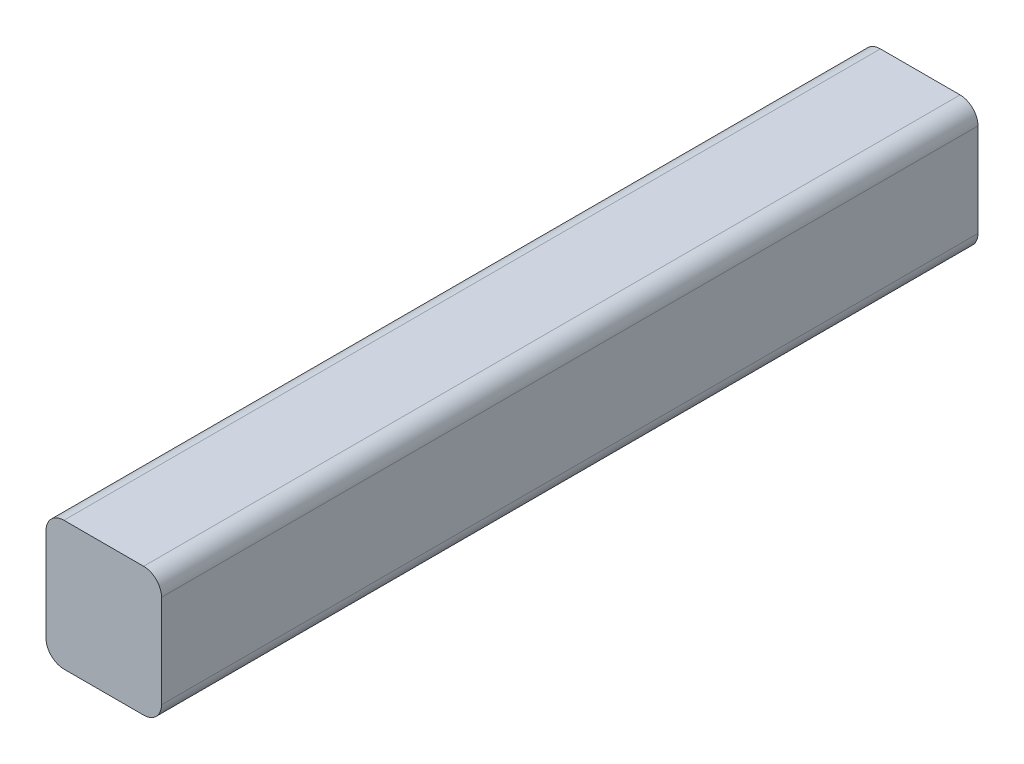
ISO-10303-21;
HEADER;
FILE_DESCRIPTION(('STEP AP214'),'2;1');
FILE_NAME('part.step','',(''),(''),'','','');
FILE_SCHEMA(('AUTOMOTIVE_DESIGN { 1 0 10303 214 1 1 1 1 }'));
ENDSEC;
DATA;
#1=APPLICATION_CONTEXT('core data for automotive mechanical design processes');
#2=APPLICATION_PROTOCOL_DEFINITION('international standard','automotive_design',2000,#1);
#3=PRODUCT_CONTEXT('',#1,'mechanical');
#4=PRODUCT('Part','Part','',(#3));
#5=PRODUCT_RELATED_PRODUCT_CATEGORY('part','',(#4));
#6=PRODUCT_DEFINITION_FORMATION('','',#4);
#7=PRODUCT_DEFINITION_CONTEXT('part definition',#1,'design');
#8=PRODUCT_DEFINITION('design','',#6,#7);
#9=PRODUCT_DEFINITION_SHAPE('','',#8);
#10=(LENGTH_UNIT() NAMED_UNIT(*) SI_UNIT(.MILLI.,.METRE.));
#11=(NAMED_UNIT(*) PLANE_ANGLE_UNIT() SI_UNIT($,.RADIAN.));
#12=(NAMED_UNIT(*) SI_UNIT($,.STERADIAN.) SOLID_ANGLE_UNIT());
#13=UNCERTAINTY_MEASURE_WITH_UNIT(LENGTH_MEASURE(1.E-05),#10,'distance_accuracy_value','');
#14=(GEOMETRIC_REPRESENTATION_CONTEXT(3) GLOBAL_UNCERTAINTY_ASSIGNED_CONTEXT((#13)) GLOBAL_UNIT_ASSIGNED_CONTEXT((#10,
#11,#12)) REPRESENTATION_CONTEXT('',''));
#15=CARTESIAN_POINT('',(0.,0.,0.));
#16=DIRECTION('',(0.,0.,1.));
#17=DIRECTION('',(1.,0.,0.));
#18=AXIS2_PLACEMENT_3D('',#15,#16,#17);
#19=CARTESIAN_POINT('',(-9.48,22.78,228.));
#20=DIRECTION('',(0.,-1.,0.));
#21=DIRECTION('',(0.,0.,-1.));
#22=AXIS2_PLACEMENT_3D('',#19,#20,#21);
#23=PLANE('',#22);
#24=DIRECTION('',(-1.,0.,0.));
#25=VECTOR('',#24,1.);
#26=CARTESIAN_POINT('',(-9.48,22.78,0.));
#27=LINE('',#26,#25);
#28=CARTESIAN_POINT('',(17.78,22.78,0.));
#29=VERTEX_POINT('',#28);
#30=CARTESIAN_POINT('',(-4.48,22.78,0.));
#31=VERTEX_POINT('',#30);
#32=EDGE_CURVE('E148',#29,#31,#27,.T.);
#33=ORIENTED_EDGE('',*,*,#32,.T.);
#34=DIRECTION('',(0.,0.,-1.));
#35=VECTOR('',#34,1.);
#36=CARTESIAN_POINT('',(-4.48,22.78,228.));
#37=LINE('',#36,#35);
#38=CARTESIAN_POINT('',(-4.48,22.78,228.));
#39=VERTEX_POINT('',#38);
#40=EDGE_CURVE('E182',#31,#39,#37,.F.);
#41=ORIENTED_EDGE('',*,*,#40,.T.);
#42=DIRECTION('',(-1.,0.,0.));
#43=VECTOR('',#42,1.);
#44=CARTESIAN_POINT('',(-9.48,22.78,228.));
#45=LINE('',#44,#43);
#46=CARTESIAN_POINT('',(17.78,22.78,228.));
#47=VERTEX_POINT('',#46);
#48=EDGE_CURVE('E146',#47,#39,#45,.T.);
#49=ORIENTED_EDGE('',*,*,#48,.F.);
#50=DIRECTION('',(0.,0.,-1.));
#51=VECTOR('',#50,1.);
#52=CARTESIAN_POINT('',(17.78,22.78,228.));
#53=LINE('',#52,#51);
#54=EDGE_CURVE('E178',#47,#29,#53,.T.);
#55=ORIENTED_EDGE('',*,*,#54,.T.);
#56=EDGE_LOOP('',(#33,#41,#49,#55));
#57=FACE_BOUND('',#56,.T.);
#58=ADVANCED_FACE('F47',(#57),#23,.F.);
#59=CARTESIAN_POINT('',(-9.47999999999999,-13.22,228.));
#60=DIRECTION('',(1.,0.,0.));
#61=DIRECTION('',(0.,1.,0.));
#62=AXIS2_PLACEMENT_3D('',#59,#60,#61);
#63=PLANE('',#62);
#64=DIRECTION('',(0.,-1.,0.));
#65=VECTOR('',#64,1.);
#66=CARTESIAN_POINT('',(-9.47999999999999,-13.22,0.));
#67=LINE('',#66,#65);
#68=CARTESIAN_POINT('',(-9.48,17.78,0.));
#69=VERTEX_POINT('',#68);
#70=CARTESIAN_POINT('',(-9.47999999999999,-8.22,0.));
#71=VERTEX_POINT('',#70);
#72=EDGE_CURVE('E142',#69,#71,#67,.T.);
#73=ORIENTED_EDGE('',*,*,#72,.T.);
#74=DIRECTION('',(0.,0.,-1.));
#75=VECTOR('',#74,1.);
#76=CARTESIAN_POINT('',(-9.47999999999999,-8.22,228.));
#77=LINE('',#76,#75);
#78=CARTESIAN_POINT('',(-9.47999999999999,-8.22,228.));
#79=VERTEX_POINT('',#78);
#80=EDGE_CURVE('E118',#71,#79,#77,.F.);
#81=ORIENTED_EDGE('',*,*,#80,.T.);
#82=DIRECTION('',(0.,-1.,0.));
#83=VECTOR('',#82,1.);
#84=CARTESIAN_POINT('',(-9.47999999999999,-13.22,228.));
#85=LINE('',#84,#83);
#86=CARTESIAN_POINT('',(-9.48,17.78,228.));
#87=VERTEX_POINT('',#86);
#88=EDGE_CURVE('E201',#87,#79,#85,.T.);
#89=ORIENTED_EDGE('',*,*,#88,.F.);
#90=DIRECTION('',(0.,0.,-1.));
#91=VECTOR('',#90,1.);
#92=CARTESIAN_POINT('',(-9.48,17.78,228.));
#93=LINE('',#92,#91);
#94=EDGE_CURVE('E124',#87,#69,#93,.T.);
#95=ORIENTED_EDGE('',*,*,#94,.T.);
#96=EDGE_LOOP('',(#73,#81,#89,#95));
#97=FACE_BOUND('',#96,.T.);
#98=ADVANCED_FACE('F222',(#97),#63,.F.);
#99=CARTESIAN_POINT('',(22.78,-13.22,228.));
#100=DIRECTION('',(0.,1.,0.));
#101=DIRECTION('',(-1.,0.,0.));
#102=AXIS2_PLACEMENT_3D('',#99,#100,#101);
#103=PLANE('',#102);
#104=DIRECTION('',(1.,0.,0.));
#105=VECTOR('',#104,1.);
#106=CARTESIAN_POINT('',(22.78,-13.22,228.));
#107=LINE('',#106,#105);
#108=CARTESIAN_POINT('',(-4.47999999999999,-13.22,228.));
#109=VERTEX_POINT('',#108);
#110=CARTESIAN_POINT('',(17.78,-13.22,228.));
#111=VERTEX_POINT('',#110);
#112=EDGE_CURVE('E133',#109,#111,#107,.T.);
#113=ORIENTED_EDGE('',*,*,#112,.F.);
#114=DIRECTION('',(0.,0.,-1.));
#115=VECTOR('',#114,1.);
#116=CARTESIAN_POINT('',(-4.47999999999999,-13.22,228.));
#117=LINE('',#116,#115);
#118=CARTESIAN_POINT('',(-4.47999999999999,-13.22,0.));
#119=VERTEX_POINT('',#118);
#120=EDGE_CURVE('E117',#109,#119,#117,.T.);
#121=ORIENTED_EDGE('',*,*,#120,.T.);
#122=DIRECTION('',(1.,0.,0.));
#123=VECTOR('',#122,1.);
#124=CARTESIAN_POINT('',(22.78,-13.22,0.));
#125=LINE('',#124,#123);
#126=CARTESIAN_POINT('',(17.78,-13.22,0.));
#127=VERTEX_POINT('',#126);
#128=EDGE_CURVE('E131',#119,#127,#125,.T.);
#129=ORIENTED_EDGE('',*,*,#128,.T.);
#130=DIRECTION('',(0.,0.,-1.));
#131=VECTOR('',#130,1.);
#132=CARTESIAN_POINT('',(17.78,-13.22,228.));
#133=LINE('',#132,#131);
#134=EDGE_CURVE('E136',#127,#111,#133,.F.);
#135=ORIENTED_EDGE('',*,*,#134,.T.);
#136=EDGE_LOOP('',(#113,#121,#129,#135));
#137=FACE_BOUND('',#136,.T.);
#138=ADVANCED_FACE('F130',(#137),#103,.F.);
#139=CARTESIAN_POINT('',(22.78,22.78,228.));
#140=DIRECTION('',(-1.,0.,0.));
#141=DIRECTION('',(0.,-1.,0.));
#142=AXIS2_PLACEMENT_3D('',#139,#140,#141);
#143=PLANE('',#142);
#144=DIRECTION('',(0.,1.,0.));
#145=VECTOR('',#144,1.);
#146=CARTESIAN_POINT('',(22.78,22.78,0.));
#147=LINE('',#146,#145);
#148=CARTESIAN_POINT('',(22.78,-8.22,0.));
#149=VERTEX_POINT('',#148);
#150=CARTESIAN_POINT('',(22.78,17.78,0.));
#151=VERTEX_POINT('',#150);
#152=EDGE_CURVE('E141',#149,#151,#147,.T.);
#153=ORIENTED_EDGE('',*,*,#152,.T.);
#154=DIRECTION('',(0.,0.,-1.));
#155=VECTOR('',#154,1.);
#156=CARTESIAN_POINT('',(22.78,17.78,228.));
#157=LINE('',#156,#155);
#158=CARTESIAN_POINT('',(22.78,17.78,228.));
#159=VERTEX_POINT('',#158);
#160=EDGE_CURVE('E11',#151,#159,#157,.F.);
#161=ORIENTED_EDGE('',*,*,#160,.T.);
#162=DIRECTION('',(0.,1.,0.));
#163=VECTOR('',#162,1.);
#164=CARTESIAN_POINT('',(22.78,22.78,228.));
#165=LINE('',#164,#163);
#166=CARTESIAN_POINT('',(22.78,-8.22,228.));
#167=VERTEX_POINT('',#166);
#168=EDGE_CURVE('E153',#167,#159,#165,.T.);
#169=ORIENTED_EDGE('',*,*,#168,.F.);
#170=DIRECTION('',(0.,0.,-1.));
#171=VECTOR('',#170,1.);
#172=CARTESIAN_POINT('',(22.78,-8.22,228.));
#173=LINE('',#172,#171);
#174=EDGE_CURVE('E56',#167,#149,#173,.T.);
#175=ORIENTED_EDGE('',*,*,#174,.T.);
#176=EDGE_LOOP('',(#153,#161,#169,#175));
#177=FACE_BOUND('',#176,.T.);
#178=ADVANCED_FACE('F187',(#177),#143,.F.);
#179=CARTESIAN_POINT('',(0.,0.,228.));
#180=DIRECTION('',(0.,0.,-1.));
#181=DIRECTION('',(-1.,0.,0.));
#182=AXIS2_PLACEMENT_3D('',#179,#180,#181);
#183=PLANE('',#182);
#184=ORIENTED_EDGE('',*,*,#88,.T.);
#185=CARTESIAN_POINT('',(-4.47999999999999,-8.22,228.));
#186=DIRECTION('',(0.,0.,-1.));
#187=DIRECTION('',(-1.,0.,0.));
#188=AXIS2_PLACEMENT_3D('',#185,#186,#187);
#189=CIRCLE('',#188,5.);
#190=EDGE_CURVE('E175',#79,#109,#189,.F.);
#191=ORIENTED_EDGE('',*,*,#190,.T.);
#192=ORIENTED_EDGE('',*,*,#112,.T.);
#193=CARTESIAN_POINT('',(17.78,-8.22,228.));
#194=DIRECTION('',(0.,0.,-1.));
#195=DIRECTION('',(-1.,0.,0.));
#196=AXIS2_PLACEMENT_3D('',#193,#194,#195);
#197=CIRCLE('',#196,5.);
#198=EDGE_CURVE('E68',#111,#167,#197,.F.);
#199=ORIENTED_EDGE('',*,*,#198,.T.);
#200=ORIENTED_EDGE('',*,*,#168,.T.);
#201=CARTESIAN_POINT('',(17.78,17.78,228.));
#202=DIRECTION('',(0.,0.,-1.));
#203=DIRECTION('',(-1.,0.,0.));
#204=AXIS2_PLACEMENT_3D('',#201,#202,#203);
#205=CIRCLE('',#204,5.);
#206=EDGE_CURVE('E169',#159,#47,#205,.F.);
#207=ORIENTED_EDGE('',*,*,#206,.T.);
#208=ORIENTED_EDGE('',*,*,#48,.T.);
#209=CARTESIAN_POINT('',(-4.48,17.78,228.));
#210=DIRECTION('',(0.,0.,-1.));
#211=DIRECTION('',(-1.,0.,0.));
#212=AXIS2_PLACEMENT_3D('',#209,#210,#211);
#213=CIRCLE('',#212,5.);
#214=EDGE_CURVE('E172',#39,#87,#213,.F.);
#215=ORIENTED_EDGE('',*,*,#214,.T.);
#216=EDGE_LOOP('',(#184,#191,#192,#199,#200,#207,#208,#215));
#217=FACE_BOUND('',#216,.T.);
#218=ADVANCED_FACE('F211',(#217),#183,.F.);
#219=CARTESIAN_POINT('',(0.,0.,0.));
#220=DIRECTION('',(0.,0.,-1.));
#221=DIRECTION('',(-1.,0.,0.));
#222=AXIS2_PLACEMENT_3D('',#219,#220,#221);
#223=PLANE('',#222);
#224=ORIENTED_EDGE('',*,*,#128,.F.);
#225=CARTESIAN_POINT('',(-4.47999999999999,-8.22,0.));
#226=DIRECTION('',(0.,0.,-1.));
#227=DIRECTION('',(-1.,0.,0.));
#228=AXIS2_PLACEMENT_3D('',#225,#226,#227);
#229=CIRCLE('',#228,5.);
#230=EDGE_CURVE('E113',#119,#71,#229,.T.);
#231=ORIENTED_EDGE('',*,*,#230,.T.);
#232=ORIENTED_EDGE('',*,*,#72,.F.);
#233=CARTESIAN_POINT('',(-4.48,17.78,0.));
#234=DIRECTION('',(0.,0.,-1.));
#235=DIRECTION('',(-1.,0.,0.));
#236=AXIS2_PLACEMENT_3D('',#233,#234,#235);
#237=CIRCLE('',#236,5.);
#238=EDGE_CURVE('E125',#69,#31,#237,.T.);
#239=ORIENTED_EDGE('',*,*,#238,.T.);
#240=ORIENTED_EDGE('',*,*,#32,.F.);
#241=CARTESIAN_POINT('',(17.78,17.78,0.));
#242=DIRECTION('',(0.,0.,-1.));
#243=DIRECTION('',(-1.,0.,0.));
#244=AXIS2_PLACEMENT_3D('',#241,#242,#243);
#245=CIRCLE('',#244,5.);
#246=EDGE_CURVE('E157',#29,#151,#245,.T.);
#247=ORIENTED_EDGE('',*,*,#246,.T.);
#248=ORIENTED_EDGE('',*,*,#152,.F.);
#249=CARTESIAN_POINT('',(17.78,-8.22,0.));
#250=DIRECTION('',(0.,0.,-1.));
#251=DIRECTION('',(-1.,0.,0.));
#252=AXIS2_PLACEMENT_3D('',#249,#250,#251);
#253=CIRCLE('',#252,5.);
#254=EDGE_CURVE('E135',#149,#127,#253,.T.);
#255=ORIENTED_EDGE('',*,*,#254,.T.);
#256=EDGE_LOOP('',(#224,#231,#232,#239,#240,#247,#248,#255));
#257=FACE_BOUND('',#256,.T.);
#258=ADVANCED_FACE('F138',(#257),#223,.T.);
#259=CARTESIAN_POINT('',(-4.47999999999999,-8.22,228.));
#260=DIRECTION('',(0.,0.,-1.));
#261=DIRECTION('',(-1.,0.,0.));
#262=AXIS2_PLACEMENT_3D('',#259,#260,#261);
#263=CYLINDRICAL_SURFACE('',#262,5.);
#264=ORIENTED_EDGE('',*,*,#190,.F.);
#265=ORIENTED_EDGE('',*,*,#80,.F.);
#266=ORIENTED_EDGE('',*,*,#230,.F.);
#267=ORIENTED_EDGE('',*,*,#120,.F.);
#268=EDGE_LOOP('',(#264,#265,#266,#267));
#269=FACE_BOUND('',#268,.T.);
#270=ADVANCED_FACE('F116',(#269),#263,.T.);
#271=CARTESIAN_POINT('',(-4.48,17.78,228.));
#272=DIRECTION('',(0.,0.,-1.));
#273=DIRECTION('',(-1.,0.,0.));
#274=AXIS2_PLACEMENT_3D('',#271,#272,#273);
#275=CYLINDRICAL_SURFACE('',#274,5.);
#276=ORIENTED_EDGE('',*,*,#214,.F.);
#277=ORIENTED_EDGE('',*,*,#40,.F.);
#278=ORIENTED_EDGE('',*,*,#238,.F.);
#279=ORIENTED_EDGE('',*,*,#94,.F.);
#280=EDGE_LOOP('',(#276,#277,#278,#279));
#281=FACE_BOUND('',#280,.T.);
#282=ADVANCED_FACE('F233',(#281),#275,.T.);
#283=CARTESIAN_POINT('',(17.78,17.78,228.));
#284=DIRECTION('',(0.,0.,-1.));
#285=DIRECTION('',(-1.,0.,0.));
#286=AXIS2_PLACEMENT_3D('',#283,#284,#285);
#287=CYLINDRICAL_SURFACE('',#286,5.);
#288=ORIENTED_EDGE('',*,*,#206,.F.);
#289=ORIENTED_EDGE('',*,*,#160,.F.);
#290=ORIENTED_EDGE('',*,*,#246,.F.);
#291=ORIENTED_EDGE('',*,*,#54,.F.);
#292=EDGE_LOOP('',(#288,#289,#290,#291));
#293=FACE_BOUND('',#292,.T.);
#294=ADVANCED_FACE('F194',(#293),#287,.T.);
#295=CARTESIAN_POINT('',(17.78,-8.22,228.));
#296=DIRECTION('',(0.,0.,-1.));
#297=DIRECTION('',(-1.,0.,0.));
#298=AXIS2_PLACEMENT_3D('',#295,#296,#297);
#299=CYLINDRICAL_SURFACE('',#298,5.);
#300=ORIENTED_EDGE('',*,*,#198,.F.);
#301=ORIENTED_EDGE('',*,*,#134,.F.);
#302=ORIENTED_EDGE('',*,*,#254,.F.);
#303=ORIENTED_EDGE('',*,*,#174,.F.);
#304=EDGE_LOOP('',(#300,#301,#302,#303));
#305=FACE_BOUND('',#304,.T.);
#306=ADVANCED_FACE('F49',(#305),#299,.T.);
#307=CLOSED_SHELL('',(#58,#98,#138,#178,#218,#258,#270,#282,#294,#306));
#308=MANIFOLD_SOLID_BREP('B2',#307);
#309=ADVANCED_BREP_SHAPE_REPRESENTATION('',(#18,#308),#14);
#310=SHAPE_DEFINITION_REPRESENTATION(#9,#309);
ENDSEC;
END-ISO-10303-21;
